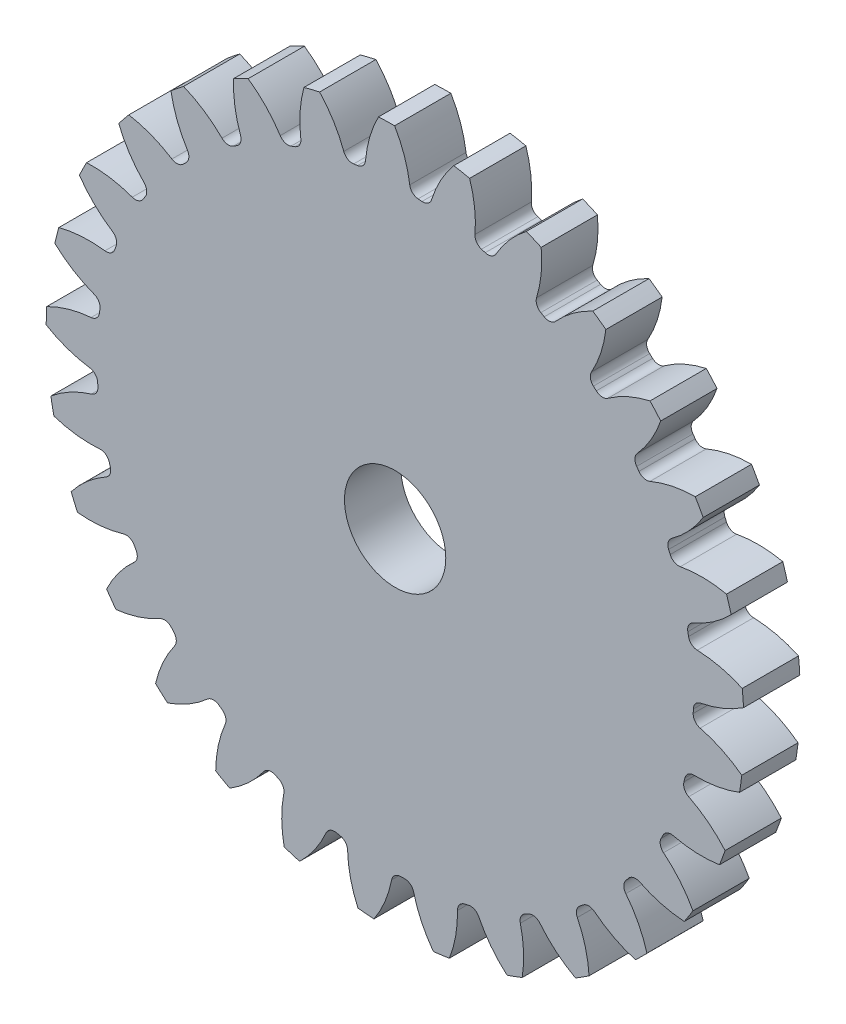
from build123d import *

# Parameters (mm, degrees)
SKETCH3_R         = 787.4
GEARBODY_DEPTH    = 127
TOOTHCUT_DEPTH    = 1121.770502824
CIRPATTERN1_COUNT = 29
BOREDIA_R         = 114.3
BORE_DEPTH        = 12700


with BuildPart() as part:
    # Sketch3 → gearBody (new body)
    with BuildSketch(Plane.XY):
        Circle(SKETCH3_R)
    extrude(amount=GEARBODY_DEPTH)

    # Sketch2 → toothCut (cut, through all)
    with BuildSketch(Plane.XY):
        with BuildLine():
            ThreePointArc((672.660466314, -24.320918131), (672.806148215, -19.887104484), (672.922605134, -15.452426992))
            ThreePointArc((672.922605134, -15.452426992), (677.801969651, -2.580487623), (689.681129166, 4.375128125))
            ThreePointArc((689.681129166, 4.375128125), (740.566047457, 19.593254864), (787.4, 44.642150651))
            ThreePointArc((787.4, 44.642150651), (788.320189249, -23.301520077), (783.3884941, -91.072218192))
            ThreePointArc((783.3884941, -91.072218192), (738.115828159, -63.300793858), (688.218611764, -45.103703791))
            ThreePointArc((688.218611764, -45.103703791), (676.771027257, -37.458585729), (672.660466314, -24.320918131))
        make_face()
    toothcut = extrude(amount=TOOTHCUT_DEPTH, mode=Mode.SUBTRACT)

    # CirPattern1: toothCut ×29 about axis
    cirpattern1_axis = Axis((0, 0, 0), (0, 0, 1))
    for i in range(1, CIRPATTERN1_COUNT):
        add(toothcut.rotate(cirpattern1_axis, i * 360 / CIRPATTERN1_COUNT), mode=Mode.SUBTRACT)

    # boreDia → bore (cut, symmetric)
    with BuildSketch(Plane.XY):
        Circle(BOREDIA_R)
    extrude(amount=BORE_DEPTH, both=True, mode=Mode.SUBTRACT)


solid = part.part
